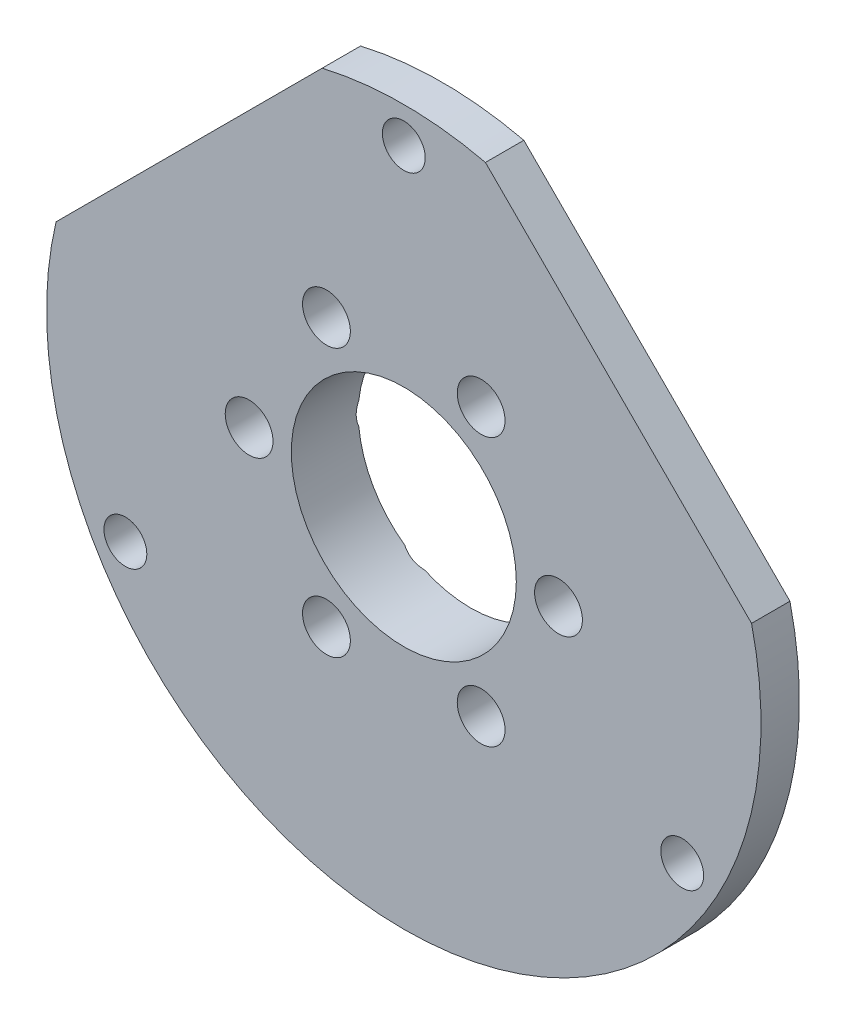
from build123d import *

# Parameters (mm, degrees)
SKETCH1_R              = 25.4
BASE_2OD_DEPTH         = 4.7625
SKETCH3_R              = 1.524
TO_FLANGE_BCD_DEPTH    = 37.235361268
SKETCH2_R              = 8
CENTER_THRU_HOLE_DEPTH = 37.235361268
MOTOR_BCD_D            = 3.4
MOTOR_BCD_CSINK_D      = 6.3
MOTOR_BCD_CSINK_ANGLE  = 90
SKETCH8_OUTSIDE_W      = 67.2
SKETCH8_OUTSIDE_H      = 67.2
SKETCH8_OUTSIDE_R      = 18.415
LIP_DEPTH              = 2.032
F_45_DEG_CUT_DEPTH     = 37.235361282
CHAMFER1_SIZE          = 0.508


with BuildPart() as part:
    # Sketch1 → base_2od (new body)
    with BuildSketch(Plane.XY):
        with Locations(Location((0, 0, 0), (0, 0, 180))):
            Circle(SKETCH1_R)
    extrude(amount=BASE_2OD_DEPTH)

    # Sketch3 → to_flange_bcd (cut, through all)
    with BuildSketch(Plane.XY.offset(4.7625)):
        with Locations((19.797340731, -11.43)):
            Circle(SKETCH3_R)
        with Locations((-19.797340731, -11.43)):
            Circle(SKETCH3_R)
        with Locations((0, 22.86)):
            Circle(SKETCH3_R)
    extrude(amount=-TO_FLANGE_BCD_DEPTH, mode=Mode.SUBTRACT)

    # Sketch2 → center_thru_hole (cut, through all)
    with BuildSketch(Plane.XY.offset(4.7625)):
        Circle(SKETCH2_R)
    extrude(amount=-CENTER_THRU_HOLE_DEPTH, mode=Mode.SUBTRACT)

    # motor_bcd (through all)
    with Locations(Plane(origin=(-11, 0, 0), x_dir=(-1, 0, 0), z_dir=(0, 0, -1))):
        with Locations((0, 0), (-5.5, 9.526279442), (-16.5, 9.526279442), (-22, 0), (-16.5, -9.526279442), (-5.5, -9.526279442)):
            CounterSinkHole(MOTOR_BCD_D / 2, MOTOR_BCD_CSINK_D / 2, counter_sink_angle=MOTOR_BCD_CSINK_ANGLE)

    # Sketch8 outside → lip (cut)
    with BuildSketch(Plane(origin=(0, 0, 0), x_dir=(-1, 0, 0), z_dir=(0, 0, -1))):
        Rectangle(SKETCH8_OUTSIDE_W, SKETCH8_OUTSIDE_H)
        Circle(SKETCH8_OUTSIDE_R, mode=Mode.SUBTRACT)
    extrude(amount=-LIP_DEPTH, mode=Mode.SUBTRACT)

    # Sketch9 → 45_DEG_CUT (cut, through all)
    with BuildSketch(Plane.XY.offset(4.7625)):
        Polygon((3.610767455, 26.922103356), (26.922103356, 3.610767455), (30.060260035, 6.748924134), (6.748924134, 30.060260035), align=None)
        Polygon((-3.610767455, 26.922103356), (-26.922103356, 3.610767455), (-30.060260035, 6.748924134), (-6.748924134, 30.060260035), align=None)
    extrude(amount=-F_45_DEG_CUT_DEPTH, mode=Mode.SUBTRACT)

    # Chamfer1
    chamfer1_edges = [part.edges().sort_by_distance(p)[0] for p in [
        (18.415, 0, 0),
    ]]
    chamfer(chamfer1_edges, length=CHAMFER1_SIZE)


solid = part.part
